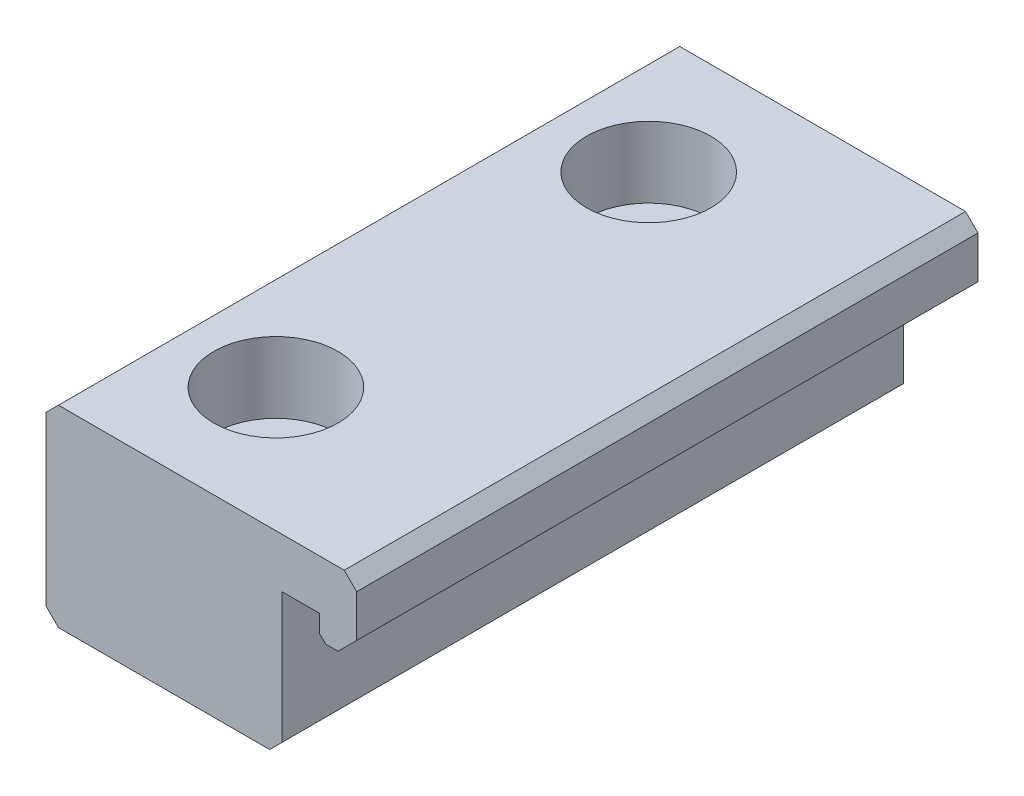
ISO-10303-21;
HEADER;
FILE_DESCRIPTION(('STEP AP214'),'2;1');
FILE_NAME('part.step','',(''),(''),'','','');
FILE_SCHEMA(('AUTOMOTIVE_DESIGN { 1 0 10303 214 1 1 1 1 }'));
ENDSEC;
DATA;
#1=APPLICATION_CONTEXT('core data for automotive mechanical design processes');
#2=APPLICATION_PROTOCOL_DEFINITION('international standard','automotive_design',2000,#1);
#3=PRODUCT_CONTEXT('',#1,'mechanical');
#4=PRODUCT('Part','Part','',(#3));
#5=PRODUCT_RELATED_PRODUCT_CATEGORY('part','',(#4));
#6=PRODUCT_DEFINITION_FORMATION('','',#4);
#7=PRODUCT_DEFINITION_CONTEXT('part definition',#1,'design');
#8=PRODUCT_DEFINITION('design','',#6,#7);
#9=PRODUCT_DEFINITION_SHAPE('','',#8);
#10=(LENGTH_UNIT() NAMED_UNIT(*) SI_UNIT(.MILLI.,.METRE.));
#11=(NAMED_UNIT(*) PLANE_ANGLE_UNIT() SI_UNIT($,.RADIAN.));
#12=(NAMED_UNIT(*) SI_UNIT($,.STERADIAN.) SOLID_ANGLE_UNIT());
#13=UNCERTAINTY_MEASURE_WITH_UNIT(LENGTH_MEASURE(1.E-05),#10,'distance_accuracy_value','');
#14=(GEOMETRIC_REPRESENTATION_CONTEXT(3) GLOBAL_UNCERTAINTY_ASSIGNED_CONTEXT((#13)) GLOBAL_UNIT_ASSIGNED_CONTEXT((#10,
#11,#12)) REPRESENTATION_CONTEXT('',''));
#15=CARTESIAN_POINT('',(0.,0.,0.));
#16=DIRECTION('',(0.,0.,1.));
#17=DIRECTION('',(1.,0.,0.));
#18=AXIS2_PLACEMENT_3D('',#15,#16,#17);
#19=CARTESIAN_POINT('',(12.5,11.5,50.));
#20=DIRECTION('',(1.,0.,0.));
#21=DIRECTION('',(0.,1.,0.));
#22=AXIS2_PLACEMENT_3D('',#19,#20,#21);
#23=PLANE('',#22);
#24=DIRECTION('',(0.,-1.,0.));
#25=VECTOR('',#24,1.);
#26=CARTESIAN_POINT('',(12.5,11.5,0.));
#27=LINE('',#26,#25);
#28=CARTESIAN_POINT('',(12.5,11.5,0.));
#29=VERTEX_POINT('',#28);
#30=CARTESIAN_POINT('',(12.5,10.1,0.));
#31=VERTEX_POINT('',#30);
#32=EDGE_CURVE('E168',#29,#31,#27,.T.);
#33=ORIENTED_EDGE('',*,*,#32,.T.);
#34=DIRECTION('',(0.,0.,1.));
#35=VECTOR('',#34,1.);
#36=CARTESIAN_POINT('',(12.5,10.1,50.));
#37=LINE('',#36,#35);
#38=CARTESIAN_POINT('',(12.5,10.1,50.));
#39=VERTEX_POINT('',#38);
#40=EDGE_CURVE('E229',#31,#39,#37,.T.);
#41=ORIENTED_EDGE('',*,*,#40,.T.);
#42=DIRECTION('',(0.,-1.,0.));
#43=VECTOR('',#42,1.);
#44=CARTESIAN_POINT('',(12.5,11.5,50.));
#45=LINE('',#44,#43);
#46=CARTESIAN_POINT('',(12.5,11.5,50.));
#47=VERTEX_POINT('',#46);
#48=EDGE_CURVE('E187',#47,#39,#45,.T.);
#49=ORIENTED_EDGE('',*,*,#48,.F.);
#50=DIRECTION('',(0.,0.,-1.));
#51=VECTOR('',#50,1.);
#52=CARTESIAN_POINT('',(12.5,11.5,50.));
#53=LINE('',#52,#51);
#54=EDGE_CURVE('E159',#47,#29,#53,.T.);
#55=ORIENTED_EDGE('',*,*,#54,.T.);
#56=EDGE_LOOP('',(#33,#41,#49,#55));
#57=FACE_BOUND('',#56,.T.);
#58=ADVANCED_FACE('F36',(#57),#23,.F.);
#59=CARTESIAN_POINT('',(12.5,9.6,50.));
#60=DIRECTION('',(0.,1.,0.));
#61=DIRECTION('',(0.,0.,1.));
#62=AXIS2_PLACEMENT_3D('',#59,#60,#61);
#63=PLANE('',#62);
#64=DIRECTION('',(1.,0.,0.));
#65=VECTOR('',#64,1.);
#66=CARTESIAN_POINT('',(12.5,9.6,0.));
#67=LINE('',#66,#65);
#68=CARTESIAN_POINT('',(13.,9.6,0.));
#69=VERTEX_POINT('',#68);
#70=CARTESIAN_POINT('',(14.,9.6,0.));
#71=VERTEX_POINT('',#70);
#72=EDGE_CURVE('E171',#69,#71,#67,.T.);
#73=ORIENTED_EDGE('',*,*,#72,.T.);
#74=DIRECTION('',(0.,0.,1.));
#75=VECTOR('',#74,1.);
#76=CARTESIAN_POINT('',(14.,9.6,50.));
#77=LINE('',#76,#75);
#78=CARTESIAN_POINT('',(14.,9.6,50.));
#79=VERTEX_POINT('',#78);
#80=EDGE_CURVE('E44',#71,#79,#77,.T.);
#81=ORIENTED_EDGE('',*,*,#80,.T.);
#82=DIRECTION('',(1.,0.,0.));
#83=VECTOR('',#82,1.);
#84=CARTESIAN_POINT('',(12.5,9.6,50.));
#85=LINE('',#84,#83);
#86=CARTESIAN_POINT('',(13.,9.6,50.));
#87=VERTEX_POINT('',#86);
#88=EDGE_CURVE('E261',#87,#79,#85,.T.);
#89=ORIENTED_EDGE('',*,*,#88,.F.);
#90=DIRECTION('',(0.,0.,-1.));
#91=VECTOR('',#90,1.);
#92=CARTESIAN_POINT('',(13.,9.6,50.));
#93=LINE('',#92,#91);
#94=EDGE_CURVE('E224',#87,#69,#93,.T.);
#95=ORIENTED_EDGE('',*,*,#94,.T.);
#96=EDGE_LOOP('',(#73,#81,#89,#95));
#97=FACE_BOUND('',#96,.T.);
#98=ADVANCED_FACE('F328',(#97),#63,.F.);
#99=CARTESIAN_POINT('',(15.5,9.6,50.));
#100=DIRECTION('',(-1.,0.,0.));
#101=DIRECTION('',(0.,0.,1.));
#102=AXIS2_PLACEMENT_3D('',#99,#100,#101);
#103=PLANE('',#102);
#104=DIRECTION('',(0.,1.,0.));
#105=VECTOR('',#104,1.);
#106=CARTESIAN_POINT('',(15.5,9.6,50.));
#107=LINE('',#106,#105);
#108=CARTESIAN_POINT('',(15.5,11.1,50.));
#109=VERTEX_POINT('',#108);
#110=CARTESIAN_POINT('',(15.5,14.5,50.));
#111=VERTEX_POINT('',#110);
#112=EDGE_CURVE('E240',#109,#111,#107,.T.);
#113=ORIENTED_EDGE('',*,*,#112,.F.);
#114=DIRECTION('',(0.,0.,-1.));
#115=VECTOR('',#114,1.);
#116=CARTESIAN_POINT('',(15.5,11.1,50.));
#117=LINE('',#116,#115);
#118=CARTESIAN_POINT('',(15.5,11.1,0.));
#119=VERTEX_POINT('',#118);
#120=EDGE_CURVE('E233',#109,#119,#117,.T.);
#121=ORIENTED_EDGE('',*,*,#120,.T.);
#122=DIRECTION('',(0.,1.,0.));
#123=VECTOR('',#122,1.);
#124=CARTESIAN_POINT('',(15.5,9.6,0.));
#125=LINE('',#124,#123);
#126=CARTESIAN_POINT('',(15.5,14.5,0.));
#127=VERTEX_POINT('',#126);
#128=EDGE_CURVE('E174',#119,#127,#125,.T.);
#129=ORIENTED_EDGE('',*,*,#128,.T.);
#130=DIRECTION('',(0.,0.,1.));
#131=VECTOR('',#130,1.);
#132=CARTESIAN_POINT('',(15.5,14.5,50.));
#133=LINE('',#132,#131);
#134=EDGE_CURVE('E202',#127,#111,#133,.T.);
#135=ORIENTED_EDGE('',*,*,#134,.T.);
#136=EDGE_LOOP('',(#113,#121,#129,#135));
#137=FACE_BOUND('',#136,.T.);
#138=ADVANCED_FACE('F239',(#137),#103,.F.);
#139=CARTESIAN_POINT('',(15.5,15.5,50.));
#140=DIRECTION('',(0.,-1.,0.));
#141=DIRECTION('',(1.,0.,0.));
#142=AXIS2_PLACEMENT_3D('',#139,#140,#141);
#143=PLANE('',#142);
#144=CARTESIAN_POINT('',(-1.00000000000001,15.5,10.));
#145=DIRECTION('',(0.,1.,0.));
#146=DIRECTION('',(0.,0.,1.));
#147=AXIS2_PLACEMENT_3D('',#144,#145,#146);
#148=CIRCLE('',#147,4.99999999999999);
#149=CARTESIAN_POINT('',(-1.00000000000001,15.5,15.));
#150=VERTEX_POINT('',#149);
#151=EDGE_CURVE('E298',#150,#150,#148,.T.);
#152=ORIENTED_EDGE('',*,*,#151,.F.);
#153=EDGE_LOOP('',(#152));
#154=FACE_BOUND('',#153,.T.);
#155=CARTESIAN_POINT('',(-1.00000000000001,15.5,40.));
#156=DIRECTION('',(0.,1.,0.));
#157=DIRECTION('',(0.,0.,1.));
#158=AXIS2_PLACEMENT_3D('',#155,#156,#157);
#159=CIRCLE('',#158,4.99999999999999);
#160=CARTESIAN_POINT('',(-1.00000000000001,15.5,45.));
#161=VERTEX_POINT('',#160);
#162=EDGE_CURVE('E286',#161,#161,#159,.T.);
#163=ORIENTED_EDGE('',*,*,#162,.F.);
#164=EDGE_LOOP('',(#163));
#165=FACE_BOUND('',#164,.T.);
#166=DIRECTION('',(-1.,0.,0.));
#167=VECTOR('',#166,1.);
#168=CARTESIAN_POINT('',(15.5,15.5,50.));
#169=LINE('',#168,#167);
#170=CARTESIAN_POINT('',(14.5,15.5,50.));
#171=VERTEX_POINT('',#170);
#172=CARTESIAN_POINT('',(-8.5,15.5,50.));
#173=VERTEX_POINT('',#172);
#174=EDGE_CURVE('E252',#171,#173,#169,.T.);
#175=ORIENTED_EDGE('',*,*,#174,.F.);
#176=DIRECTION('',(0.,0.,-1.));
#177=VECTOR('',#176,1.);
#178=CARTESIAN_POINT('',(14.5,15.5,50.));
#179=LINE('',#178,#177);
#180=CARTESIAN_POINT('',(14.5,15.5,0.));
#181=VERTEX_POINT('',#180);
#182=EDGE_CURVE('E190',#171,#181,#179,.T.);
#183=ORIENTED_EDGE('',*,*,#182,.T.);
#184=DIRECTION('',(-1.,0.,0.));
#185=VECTOR('',#184,1.);
#186=CARTESIAN_POINT('',(15.5,15.5,0.));
#187=LINE('',#186,#185);
#188=CARTESIAN_POINT('',(-8.5,15.5,0.));
#189=VERTEX_POINT('',#188);
#190=EDGE_CURVE('E176',#181,#189,#187,.T.);
#191=ORIENTED_EDGE('',*,*,#190,.T.);
#192=DIRECTION('',(0.,0.,1.));
#193=VECTOR('',#192,1.);
#194=CARTESIAN_POINT('',(-8.5,15.5,50.));
#195=LINE('',#194,#193);
#196=EDGE_CURVE('E158',#189,#173,#195,.T.);
#197=ORIENTED_EDGE('',*,*,#196,.T.);
#198=EDGE_LOOP('',(#175,#183,#191,#197));
#199=FACE_BOUND('',#198,.T.);
#200=ADVANCED_FACE('F255',(#154,#165,#199),#143,.F.);
#201=CARTESIAN_POINT('',(-9.5,15.5,50.));
#202=DIRECTION('',(1.,0.,0.));
#203=DIRECTION('',(0.,1.,0.));
#204=AXIS2_PLACEMENT_3D('',#201,#202,#203);
#205=PLANE('',#204);
#206=DIRECTION('',(0.,-1.,0.));
#207=VECTOR('',#206,1.);
#208=CARTESIAN_POINT('',(-9.5,15.5,50.));
#209=LINE('',#208,#207);
#210=CARTESIAN_POINT('',(-9.5,14.5,50.));
#211=VERTEX_POINT('',#210);
#212=CARTESIAN_POINT('',(-9.49999999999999,1.,50.));
#213=VERTEX_POINT('',#212);
#214=EDGE_CURVE('E257',#211,#213,#209,.T.);
#215=ORIENTED_EDGE('',*,*,#214,.F.);
#216=DIRECTION('',(0.,0.,-1.));
#217=VECTOR('',#216,1.);
#218=CARTESIAN_POINT('',(-9.5,14.5,50.));
#219=LINE('',#218,#217);
#220=CARTESIAN_POINT('',(-9.5,14.5,0.));
#221=VERTEX_POINT('',#220);
#222=EDGE_CURVE('E214',#211,#221,#219,.T.);
#223=ORIENTED_EDGE('',*,*,#222,.T.);
#224=DIRECTION('',(0.,-1.,0.));
#225=VECTOR('',#224,1.);
#226=CARTESIAN_POINT('',(-9.5,15.5,0.));
#227=LINE('',#226,#225);
#228=CARTESIAN_POINT('',(-9.49999999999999,1.,0.));
#229=VERTEX_POINT('',#228);
#230=EDGE_CURVE('E179',#221,#229,#227,.T.);
#231=ORIENTED_EDGE('',*,*,#230,.T.);
#232=DIRECTION('',(0.,0.,1.));
#233=VECTOR('',#232,1.);
#234=CARTESIAN_POINT('',(-9.49999999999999,1.,50.));
#235=LINE('',#234,#233);
#236=EDGE_CURVE('E212',#229,#213,#235,.T.);
#237=ORIENTED_EDGE('',*,*,#236,.T.);
#238=EDGE_LOOP('',(#215,#223,#231,#237));
#239=FACE_BOUND('',#238,.T.);
#240=ADVANCED_FACE('F306',(#239),#205,.F.);
#241=CARTESIAN_POINT('',(-9.49999999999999,0.,50.));
#242=DIRECTION('',(0.,1.,0.));
#243=DIRECTION('',(0.,0.,1.));
#244=AXIS2_PLACEMENT_3D('',#241,#242,#243);
#245=PLANE('',#244);
#246=CARTESIAN_POINT('',(-1.00000000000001,0.,10.));
#247=DIRECTION('',(0.,1.,0.));
#248=DIRECTION('',(0.,0.,1.));
#249=AXIS2_PLACEMENT_3D('',#246,#247,#248);
#250=CIRCLE('',#249,2.75);
#251=CARTESIAN_POINT('',(-1.00000000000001,0.,12.75));
#252=VERTEX_POINT('',#251);
#253=EDGE_CURVE('E289',#252,#252,#250,.T.);
#254=ORIENTED_EDGE('',*,*,#253,.T.);
#255=EDGE_LOOP('',(#254));
#256=FACE_BOUND('',#255,.T.);
#257=CARTESIAN_POINT('',(-1.00000000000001,0.,40.));
#258=DIRECTION('',(0.,1.,0.));
#259=DIRECTION('',(0.,0.,1.));
#260=AXIS2_PLACEMENT_3D('',#257,#258,#259);
#261=CIRCLE('',#260,2.75);
#262=CARTESIAN_POINT('',(-1.00000000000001,0.,42.75));
#263=VERTEX_POINT('',#262);
#264=EDGE_CURVE('E172',#263,#263,#261,.T.);
#265=ORIENTED_EDGE('',*,*,#264,.T.);
#266=EDGE_LOOP('',(#265));
#267=FACE_BOUND('',#266,.T.);
#268=DIRECTION('',(1.,0.,0.));
#269=VECTOR('',#268,1.);
#270=CARTESIAN_POINT('',(-9.49999999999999,0.,50.));
#271=LINE('',#270,#269);
#272=CARTESIAN_POINT('',(-8.5,0.,50.));
#273=VERTEX_POINT('',#272);
#274=CARTESIAN_POINT('',(8.5,0.,50.));
#275=VERTEX_POINT('',#274);
#276=EDGE_CURVE('E149',#273,#275,#271,.T.);
#277=ORIENTED_EDGE('',*,*,#276,.F.);
#278=DIRECTION('',(0.,0.,-1.));
#279=VECTOR('',#278,1.);
#280=CARTESIAN_POINT('',(-8.5,0.,50.));
#281=LINE('',#280,#279);
#282=CARTESIAN_POINT('',(-8.5,0.,0.));
#283=VERTEX_POINT('',#282);
#284=EDGE_CURVE('E219',#273,#283,#281,.T.);
#285=ORIENTED_EDGE('',*,*,#284,.T.);
#286=DIRECTION('',(1.,0.,0.));
#287=VECTOR('',#286,1.);
#288=CARTESIAN_POINT('',(-9.49999999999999,0.,0.));
#289=LINE('',#288,#287);
#290=CARTESIAN_POINT('',(8.5,0.,0.));
#291=VERTEX_POINT('',#290);
#292=EDGE_CURVE('E182',#283,#291,#289,.T.);
#293=ORIENTED_EDGE('',*,*,#292,.T.);
#294=DIRECTION('',(0.,0.,1.));
#295=VECTOR('',#294,1.);
#296=CARTESIAN_POINT('',(8.5,0.,50.));
#297=LINE('',#296,#295);
#298=EDGE_CURVE('E217',#291,#275,#297,.T.);
#299=ORIENTED_EDGE('',*,*,#298,.T.);
#300=EDGE_LOOP('',(#277,#285,#293,#299));
#301=FACE_BOUND('',#300,.T.);
#302=ADVANCED_FACE('F372',(#256,#267,#301),#245,.F.);
#303=CARTESIAN_POINT('',(9.5,0.,50.));
#304=DIRECTION('',(-1.,0.,0.));
#305=DIRECTION('',(0.,-1.,0.));
#306=AXIS2_PLACEMENT_3D('',#303,#304,#305);
#307=PLANE('',#306);
#308=DIRECTION('',(0.,1.,0.));
#309=VECTOR('',#308,1.);
#310=CARTESIAN_POINT('',(9.5,0.,50.));
#311=LINE('',#310,#309);
#312=CARTESIAN_POINT('',(9.5,1.,50.));
#313=VERTEX_POINT('',#312);
#314=CARTESIAN_POINT('',(9.50000000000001,11.5,50.));
#315=VERTEX_POINT('',#314);
#316=EDGE_CURVE('E136',#313,#315,#311,.T.);
#317=ORIENTED_EDGE('',*,*,#316,.F.);
#318=DIRECTION('',(0.,0.,-1.));
#319=VECTOR('',#318,1.);
#320=CARTESIAN_POINT('',(9.5,1.,50.));
#321=LINE('',#320,#319);
#322=CARTESIAN_POINT('',(9.5,1.,0.));
#323=VERTEX_POINT('',#322);
#324=EDGE_CURVE('E222',#313,#323,#321,.T.);
#325=ORIENTED_EDGE('',*,*,#324,.T.);
#326=DIRECTION('',(0.,1.,0.));
#327=VECTOR('',#326,1.);
#328=CARTESIAN_POINT('',(9.5,0.,0.));
#329=LINE('',#328,#327);
#330=CARTESIAN_POINT('',(9.50000000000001,11.5,0.));
#331=VERTEX_POINT('',#330);
#332=EDGE_CURVE('E155',#323,#331,#329,.T.);
#333=ORIENTED_EDGE('',*,*,#332,.T.);
#334=DIRECTION('',(0.,0.,-1.));
#335=VECTOR('',#334,1.);
#336=CARTESIAN_POINT('',(9.50000000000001,11.5,50.));
#337=LINE('',#336,#335);
#338=EDGE_CURVE('E152',#315,#331,#337,.T.);
#339=ORIENTED_EDGE('',*,*,#338,.F.);
#340=EDGE_LOOP('',(#317,#325,#333,#339));
#341=FACE_BOUND('',#340,.T.);
#342=ADVANCED_FACE('F153',(#341),#307,.F.);
#343=CARTESIAN_POINT('',(9.50000000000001,11.5,50.));
#344=DIRECTION('',(0.,1.,0.));
#345=DIRECTION('',(0.,0.,1.));
#346=AXIS2_PLACEMENT_3D('',#343,#344,#345);
#347=PLANE('',#346);
#348=DIRECTION('',(1.,0.,0.));
#349=VECTOR('',#348,1.);
#350=CARTESIAN_POINT('',(9.50000000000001,11.5,0.));
#351=LINE('',#350,#349);
#352=EDGE_CURVE('E186',#331,#29,#351,.T.);
#353=ORIENTED_EDGE('',*,*,#352,.T.);
#354=ORIENTED_EDGE('',*,*,#54,.F.);
#355=DIRECTION('',(1.,0.,0.));
#356=VECTOR('',#355,1.);
#357=CARTESIAN_POINT('',(9.50000000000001,11.5,50.));
#358=LINE('',#357,#356);
#359=EDGE_CURVE('E141',#315,#47,#358,.T.);
#360=ORIENTED_EDGE('',*,*,#359,.F.);
#361=ORIENTED_EDGE('',*,*,#338,.T.);
#362=EDGE_LOOP('',(#353,#354,#360,#361));
#363=FACE_BOUND('',#362,.T.);
#364=ADVANCED_FACE('F161',(#363),#347,.F.);
#365=CARTESIAN_POINT('',(0.,0.,50.));
#366=DIRECTION('',(0.,0.,1.));
#367=DIRECTION('',(1.,0.,0.));
#368=AXIS2_PLACEMENT_3D('',#365,#366,#367);
#369=PLANE('',#368);
#370=ORIENTED_EDGE('',*,*,#88,.T.);
#371=DIRECTION('',(-0.707106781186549,-0.707106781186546,0.));
#372=VECTOR('',#371,1.);
#373=CARTESIAN_POINT('',(2.19999999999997,-2.19999999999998,50.));
#374=LINE('',#373,#372);
#375=EDGE_CURVE('E11',#79,#109,#374,.F.);
#376=ORIENTED_EDGE('',*,*,#375,.T.);
#377=ORIENTED_EDGE('',*,*,#112,.T.);
#378=DIRECTION('',(0.707106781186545,-0.70710678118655,0.));
#379=VECTOR('',#378,1.);
#380=CARTESIAN_POINT('',(15.0000000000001,14.9999999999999,50.));
#381=LINE('',#380,#379);
#382=EDGE_CURVE('E210',#111,#171,#381,.F.);
#383=ORIENTED_EDGE('',*,*,#382,.T.);
#384=ORIENTED_EDGE('',*,*,#174,.T.);
#385=DIRECTION('',(0.70710678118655,0.707106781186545,0.));
#386=VECTOR('',#385,1.);
#387=CARTESIAN_POINT('',(-12.,12.,50.));
#388=LINE('',#387,#386);
#389=EDGE_CURVE('E208',#173,#211,#388,.F.);
#390=ORIENTED_EDGE('',*,*,#389,.T.);
#391=ORIENTED_EDGE('',*,*,#214,.T.);
#392=DIRECTION('',(-0.707106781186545,0.70710678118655,0.));
#393=VECTOR('',#392,1.);
#394=CARTESIAN_POINT('',(-4.25000000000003,-4.25,50.));
#395=LINE('',#394,#393);
#396=EDGE_CURVE('E206',#213,#273,#395,.F.);
#397=ORIENTED_EDGE('',*,*,#396,.T.);
#398=ORIENTED_EDGE('',*,*,#276,.T.);
#399=DIRECTION('',(-0.707106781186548,-0.707106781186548,0.));
#400=VECTOR('',#399,1.);
#401=CARTESIAN_POINT('',(4.25,-4.25,50.));
#402=LINE('',#401,#400);
#403=EDGE_CURVE('E145',#275,#313,#402,.F.);
#404=ORIENTED_EDGE('',*,*,#403,.T.);
#405=ORIENTED_EDGE('',*,*,#316,.T.);
#406=ORIENTED_EDGE('',*,*,#359,.T.);
#407=ORIENTED_EDGE('',*,*,#48,.T.);
#408=DIRECTION('',(-0.707106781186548,0.707106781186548,0.));
#409=VECTOR('',#408,1.);
#410=CARTESIAN_POINT('',(11.3,11.3,50.));
#411=LINE('',#410,#409);
#412=EDGE_CURVE('E231',#39,#87,#411,.F.);
#413=ORIENTED_EDGE('',*,*,#412,.T.);
#414=EDGE_LOOP('',(#370,#376,#377,#383,#384,#390,#391,#397,#398,#404,#405,#406,#407,#413));
#415=FACE_BOUND('',#414,.T.);
#416=ADVANCED_FACE('F138',(#415),#369,.T.);
#417=CARTESIAN_POINT('',(0.,0.,0.));
#418=DIRECTION('',(0.,0.,1.));
#419=DIRECTION('',(1.,0.,0.));
#420=AXIS2_PLACEMENT_3D('',#417,#418,#419);
#421=PLANE('',#420);
#422=ORIENTED_EDGE('',*,*,#128,.F.);
#423=DIRECTION('',(0.707106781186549,0.707106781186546,0.));
#424=VECTOR('',#423,1.);
#425=CARTESIAN_POINT('',(15.5,11.1,0.));
#426=LINE('',#425,#424);
#427=EDGE_CURVE('E58',#119,#71,#426,.F.);
#428=ORIENTED_EDGE('',*,*,#427,.T.);
#429=ORIENTED_EDGE('',*,*,#72,.F.);
#430=DIRECTION('',(0.707106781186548,-0.707106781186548,0.));
#431=VECTOR('',#430,1.);
#432=CARTESIAN_POINT('',(13.,9.6,0.));
#433=LINE('',#432,#431);
#434=EDGE_CURVE('E227',#69,#31,#433,.F.);
#435=ORIENTED_EDGE('',*,*,#434,.T.);
#436=ORIENTED_EDGE('',*,*,#32,.F.);
#437=ORIENTED_EDGE('',*,*,#352,.F.);
#438=ORIENTED_EDGE('',*,*,#332,.F.);
#439=DIRECTION('',(0.707106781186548,0.707106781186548,0.));
#440=VECTOR('',#439,1.);
#441=CARTESIAN_POINT('',(9.5,1.,0.));
#442=LINE('',#441,#440);
#443=EDGE_CURVE('E193',#323,#291,#442,.F.);
#444=ORIENTED_EDGE('',*,*,#443,.T.);
#445=ORIENTED_EDGE('',*,*,#292,.F.);
#446=DIRECTION('',(0.707106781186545,-0.70710678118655,0.));
#447=VECTOR('',#446,1.);
#448=CARTESIAN_POINT('',(-8.5,0.,0.));
#449=LINE('',#448,#447);
#450=EDGE_CURVE('E195',#283,#229,#449,.F.);
#451=ORIENTED_EDGE('',*,*,#450,.T.);
#452=ORIENTED_EDGE('',*,*,#230,.F.);
#453=DIRECTION('',(-0.70710678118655,-0.707106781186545,0.));
#454=VECTOR('',#453,1.);
#455=CARTESIAN_POINT('',(-9.5,14.5,0.));
#456=LINE('',#455,#454);
#457=EDGE_CURVE('E197',#221,#189,#456,.F.);
#458=ORIENTED_EDGE('',*,*,#457,.T.);
#459=ORIENTED_EDGE('',*,*,#190,.F.);
#460=DIRECTION('',(-0.707106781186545,0.70710678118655,0.));
#461=VECTOR('',#460,1.);
#462=CARTESIAN_POINT('',(14.5,15.5,0.));
#463=LINE('',#462,#461);
#464=EDGE_CURVE('E199',#181,#127,#463,.F.);
#465=ORIENTED_EDGE('',*,*,#464,.T.);
#466=EDGE_LOOP('',(#422,#428,#429,#435,#436,#437,#438,#444,#445,#451,#452,#458,#459,#465));
#467=FACE_BOUND('',#466,.T.);
#468=ADVANCED_FACE('F243',(#467),#421,.F.);
#469=CARTESIAN_POINT('',(14.5,15.5,50.));
#470=DIRECTION('',(-0.70710678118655,-0.707106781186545,0.));
#471=DIRECTION('',(0.,0.,-1.));
#472=AXIS2_PLACEMENT_3D('',#469,#470,#471);
#473=PLANE('',#472);
#474=ORIENTED_EDGE('',*,*,#382,.F.);
#475=ORIENTED_EDGE('',*,*,#134,.F.);
#476=ORIENTED_EDGE('',*,*,#464,.F.);
#477=ORIENTED_EDGE('',*,*,#182,.F.);
#478=EDGE_LOOP('',(#474,#475,#476,#477));
#479=FACE_BOUND('',#478,.T.);
#480=ADVANCED_FACE('F249',(#479),#473,.F.);
#481=CARTESIAN_POINT('',(-9.5,14.5,50.));
#482=DIRECTION('',(0.707106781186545,-0.70710678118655,0.));
#483=DIRECTION('',(0.,0.,-1.));
#484=AXIS2_PLACEMENT_3D('',#481,#482,#483);
#485=PLANE('',#484);
#486=ORIENTED_EDGE('',*,*,#389,.F.);
#487=ORIENTED_EDGE('',*,*,#196,.F.);
#488=ORIENTED_EDGE('',*,*,#457,.F.);
#489=ORIENTED_EDGE('',*,*,#222,.F.);
#490=EDGE_LOOP('',(#486,#487,#488,#489));
#491=FACE_BOUND('',#490,.T.);
#492=ADVANCED_FACE('F338',(#491),#485,.F.);
#493=CARTESIAN_POINT('',(-8.5,0.,50.));
#494=DIRECTION('',(0.70710678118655,0.707106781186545,0.));
#495=DIRECTION('',(0.,0.,-1.));
#496=AXIS2_PLACEMENT_3D('',#493,#494,#495);
#497=PLANE('',#496);
#498=ORIENTED_EDGE('',*,*,#396,.F.);
#499=ORIENTED_EDGE('',*,*,#236,.F.);
#500=ORIENTED_EDGE('',*,*,#450,.F.);
#501=ORIENTED_EDGE('',*,*,#284,.F.);
#502=EDGE_LOOP('',(#498,#499,#500,#501));
#503=FACE_BOUND('',#502,.T.);
#504=ADVANCED_FACE('F341',(#503),#497,.F.);
#505=CARTESIAN_POINT('',(9.5,1.,50.));
#506=DIRECTION('',(-0.707106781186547,0.707106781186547,0.));
#507=DIRECTION('',(0.,0.,-1.));
#508=AXIS2_PLACEMENT_3D('',#505,#506,#507);
#509=PLANE('',#508);
#510=ORIENTED_EDGE('',*,*,#403,.F.);
#511=ORIENTED_EDGE('',*,*,#298,.F.);
#512=ORIENTED_EDGE('',*,*,#443,.F.);
#513=ORIENTED_EDGE('',*,*,#324,.F.);
#514=EDGE_LOOP('',(#510,#511,#512,#513));
#515=FACE_BOUND('',#514,.T.);
#516=ADVANCED_FACE('F270',(#515),#509,.F.);
#517=CARTESIAN_POINT('',(13.,9.6,50.));
#518=DIRECTION('',(0.707106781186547,0.707106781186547,0.));
#519=DIRECTION('',(0.,0.,-1.));
#520=AXIS2_PLACEMENT_3D('',#517,#518,#519);
#521=PLANE('',#520);
#522=ORIENTED_EDGE('',*,*,#412,.F.);
#523=ORIENTED_EDGE('',*,*,#40,.F.);
#524=ORIENTED_EDGE('',*,*,#434,.F.);
#525=ORIENTED_EDGE('',*,*,#94,.F.);
#526=EDGE_LOOP('',(#522,#523,#524,#525));
#527=FACE_BOUND('',#526,.T.);
#528=ADVANCED_FACE('F347',(#527),#521,.F.);
#529=CARTESIAN_POINT('',(15.5,11.1,50.));
#530=DIRECTION('',(-0.707106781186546,0.707106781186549,0.));
#531=DIRECTION('',(0.,0.,-1.));
#532=AXIS2_PLACEMENT_3D('',#529,#530,#531);
#533=PLANE('',#532);
#534=ORIENTED_EDGE('',*,*,#375,.F.);
#535=ORIENTED_EDGE('',*,*,#80,.F.);
#536=ORIENTED_EDGE('',*,*,#427,.F.);
#537=ORIENTED_EDGE('',*,*,#120,.F.);
#538=EDGE_LOOP('',(#534,#535,#536,#537));
#539=FACE_BOUND('',#538,.T.);
#540=ADVANCED_FACE('F38',(#539),#533,.F.);
#541=CARTESIAN_POINT('',(-1.00000000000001,15.5,40.));
#542=DIRECTION('',(0.,1.,0.));
#543=DIRECTION('',(0.,0.,1.));
#544=AXIS2_PLACEMENT_3D('',#541,#542,#543);
#545=CYLINDRICAL_SURFACE('',#544,2.75);
#546=ORIENTED_EDGE('',*,*,#264,.F.);
#547=EDGE_LOOP('',(#546));
#548=FACE_BOUND('',#547,.T.);
#549=CARTESIAN_POINT('',(-1.00000000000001,9.8,40.));
#550=DIRECTION('',(0.,1.,0.));
#551=DIRECTION('',(0.,0.,1.));
#552=AXIS2_PLACEMENT_3D('',#549,#550,#551);
#553=CIRCLE('',#552,2.75);
#554=CARTESIAN_POINT('',(-1.00000000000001,9.8,42.75));
#555=VERTEX_POINT('',#554);
#556=EDGE_CURVE('E280',#555,#555,#553,.T.);
#557=ORIENTED_EDGE('',*,*,#556,.T.);
#558=EDGE_LOOP('',(#557));
#559=FACE_BOUND('',#558,.T.);
#560=ADVANCED_FACE('F323',(#548,#559),#545,.F.);
#561=CARTESIAN_POINT('',(1.74999999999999,9.8,40.));
#562=DIRECTION('',(0.,-1.,0.));
#563=DIRECTION('',(0.,0.,-1.));
#564=AXIS2_PLACEMENT_3D('',#561,#562,#563);
#565=PLANE('',#564);
#566=ORIENTED_EDGE('',*,*,#556,.F.);
#567=EDGE_LOOP('',(#566));
#568=FACE_BOUND('',#567,.T.);
#569=CARTESIAN_POINT('',(-1.00000000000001,9.8,40.));
#570=DIRECTION('',(0.,1.,0.));
#571=DIRECTION('',(0.,0.,1.));
#572=AXIS2_PLACEMENT_3D('',#569,#570,#571);
#573=CIRCLE('',#572,5.);
#574=CARTESIAN_POINT('',(-1.00000000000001,9.8,45.));
#575=VERTEX_POINT('',#574);
#576=EDGE_CURVE('E283',#575,#575,#573,.T.);
#577=ORIENTED_EDGE('',*,*,#576,.T.);
#578=EDGE_LOOP('',(#577));
#579=FACE_BOUND('',#578,.T.);
#580=ADVANCED_FACE('F313',(#568,#579),#565,.F.);
#581=CARTESIAN_POINT('',(-1.00000000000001,15.5,40.));
#582=DIRECTION('',(0.,1.,0.));
#583=DIRECTION('',(0.,0.,1.));
#584=AXIS2_PLACEMENT_3D('',#581,#582,#583);
#585=CYLINDRICAL_SURFACE('',#584,4.99999999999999);
#586=ORIENTED_EDGE('',*,*,#576,.F.);
#587=EDGE_LOOP('',(#586));
#588=FACE_BOUND('',#587,.T.);
#589=ORIENTED_EDGE('',*,*,#162,.T.);
#590=EDGE_LOOP('',(#589));
#591=FACE_BOUND('',#590,.T.);
#592=ADVANCED_FACE('F310',(#588,#591),#585,.F.);
#593=CARTESIAN_POINT('',(-1.00000000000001,15.5,10.));
#594=DIRECTION('',(0.,1.,0.));
#595=DIRECTION('',(0.,0.,1.));
#596=AXIS2_PLACEMENT_3D('',#593,#594,#595);
#597=CYLINDRICAL_SURFACE('',#596,2.75);
#598=ORIENTED_EDGE('',*,*,#253,.F.);
#599=EDGE_LOOP('',(#598));
#600=FACE_BOUND('',#599,.T.);
#601=CARTESIAN_POINT('',(-1.00000000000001,9.8,10.));
#602=DIRECTION('',(0.,1.,0.));
#603=DIRECTION('',(0.,0.,1.));
#604=AXIS2_PLACEMENT_3D('',#601,#602,#603);
#605=CIRCLE('',#604,2.75);
#606=CARTESIAN_POINT('',(-1.00000000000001,9.8,12.75));
#607=VERTEX_POINT('',#606);
#608=EDGE_CURVE('E292',#607,#607,#605,.T.);
#609=ORIENTED_EDGE('',*,*,#608,.T.);
#610=EDGE_LOOP('',(#609));
#611=FACE_BOUND('',#610,.T.);
#612=ADVANCED_FACE('F312',(#600,#611),#597,.F.);
#613=CARTESIAN_POINT('',(1.74999999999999,9.8,10.));
#614=DIRECTION('',(0.,-1.,0.));
#615=DIRECTION('',(0.,0.,-1.));
#616=AXIS2_PLACEMENT_3D('',#613,#614,#615);
#617=PLANE('',#616);
#618=ORIENTED_EDGE('',*,*,#608,.F.);
#619=EDGE_LOOP('',(#618));
#620=FACE_BOUND('',#619,.T.);
#621=CARTESIAN_POINT('',(-1.00000000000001,9.8,10.));
#622=DIRECTION('',(0.,1.,0.));
#623=DIRECTION('',(0.,0.,1.));
#624=AXIS2_PLACEMENT_3D('',#621,#622,#623);
#625=CIRCLE('',#624,5.);
#626=CARTESIAN_POINT('',(-1.00000000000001,9.8,15.));
#627=VERTEX_POINT('',#626);
#628=EDGE_CURVE('E295',#627,#627,#625,.T.);
#629=ORIENTED_EDGE('',*,*,#628,.T.);
#630=EDGE_LOOP('',(#629));
#631=FACE_BOUND('',#630,.T.);
#632=ADVANCED_FACE('F320',(#620,#631),#617,.F.);
#633=CARTESIAN_POINT('',(-1.00000000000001,15.5,10.));
#634=DIRECTION('',(0.,1.,0.));
#635=DIRECTION('',(0.,0.,1.));
#636=AXIS2_PLACEMENT_3D('',#633,#634,#635);
#637=CYLINDRICAL_SURFACE('',#636,4.99999999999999);
#638=ORIENTED_EDGE('',*,*,#628,.F.);
#639=EDGE_LOOP('',(#638));
#640=FACE_BOUND('',#639,.T.);
#641=ORIENTED_EDGE('',*,*,#151,.T.);
#642=EDGE_LOOP('',(#641));
#643=FACE_BOUND('',#642,.T.);
#644=ADVANCED_FACE('F302',(#640,#643),#637,.F.);
#645=CLOSED_SHELL('',(#58,#98,#138,#200,#240,#302,#342,#364,#416,#468,#480,#492,#504,#516,#528,
#540,#560,#580,#592,#612,#632,#644));
#646=MANIFOLD_SOLID_BREP('B2',#645);
#647=ADVANCED_BREP_SHAPE_REPRESENTATION('',(#18,#646),#14);
#648=SHAPE_DEFINITION_REPRESENTATION(#9,#647);
ENDSEC;
END-ISO-10303-21;
